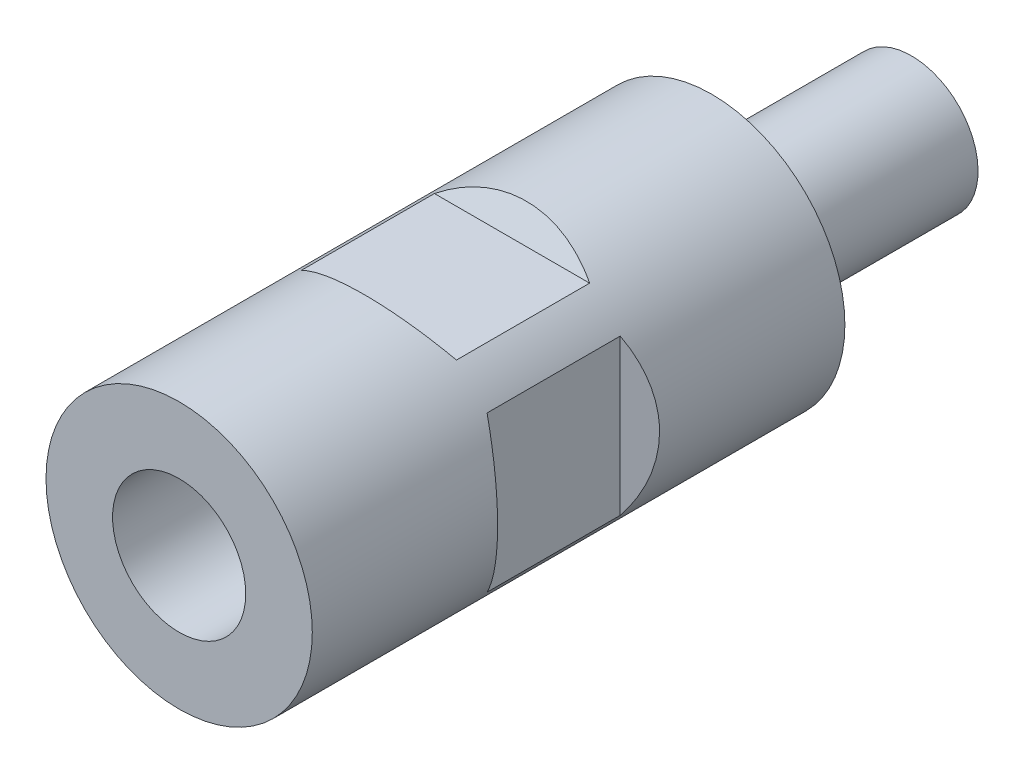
ISO-10303-21;
HEADER;
FILE_DESCRIPTION(('STEP AP214'),'2;1');
FILE_NAME('part.step','',(''),(''),'','','');
FILE_SCHEMA(('AUTOMOTIVE_DESIGN { 1 0 10303 214 1 1 1 1 }'));
ENDSEC;
DATA;
#1=APPLICATION_CONTEXT('core data for automotive mechanical design processes');
#2=APPLICATION_PROTOCOL_DEFINITION('international standard','automotive_design',2000,#1);
#3=PRODUCT_CONTEXT('',#1,'mechanical');
#4=PRODUCT('Part','Part','',(#3));
#5=PRODUCT_RELATED_PRODUCT_CATEGORY('part','',(#4));
#6=PRODUCT_DEFINITION_FORMATION('','',#4);
#7=PRODUCT_DEFINITION_CONTEXT('part definition',#1,'design');
#8=PRODUCT_DEFINITION('design','',#6,#7);
#9=PRODUCT_DEFINITION_SHAPE('','',#8);
#10=(LENGTH_UNIT() NAMED_UNIT(*) SI_UNIT(.MILLI.,.METRE.));
#11=(NAMED_UNIT(*) PLANE_ANGLE_UNIT() SI_UNIT($,.RADIAN.));
#12=(NAMED_UNIT(*) SI_UNIT($,.STERADIAN.) SOLID_ANGLE_UNIT());
#13=UNCERTAINTY_MEASURE_WITH_UNIT(LENGTH_MEASURE(1.E-05),#10,'distance_accuracy_value','');
#14=(GEOMETRIC_REPRESENTATION_CONTEXT(3) GLOBAL_UNCERTAINTY_ASSIGNED_CONTEXT((#13)) GLOBAL_UNIT_ASSIGNED_CONTEXT((#10,
#11,#12)) REPRESENTATION_CONTEXT('',''));
#15=CARTESIAN_POINT('',(0.,0.,0.));
#16=DIRECTION('',(0.,0.,1.));
#17=DIRECTION('',(1.,0.,0.));
#18=AXIS2_PLACEMENT_3D('',#15,#16,#17);
#19=CARTESIAN_POINT('',(0.,0.,-12.));
#20=DIRECTION('',(0.,0.,1.));
#21=DIRECTION('',(0.,-1.,0.));
#22=AXIS2_PLACEMENT_3D('',#19,#20,#21);
#23=PLANE('',#22);
#24=CARTESIAN_POINT('',(0.,0.,-12.));
#25=DIRECTION('',(0.,0.,1.));
#26=DIRECTION('',(0.,-1.,0.));
#27=AXIS2_PLACEMENT_3D('',#24,#25,#26);
#28=CIRCLE('',#27,4.);
#29=CARTESIAN_POINT('',(0.,-4.,-12.));
#30=VERTEX_POINT('',#29);
#31=EDGE_CURVE('E103',#30,#30,#28,.F.);
#32=ORIENTED_EDGE('',*,*,#31,.T.);
#33=EDGE_LOOP('',(#32));
#34=FACE_BOUND('',#33,.T.);
#35=ADVANCED_FACE('F14',(#34),#23,.F.);
#36=CARTESIAN_POINT('',(0.,0.,8.));
#37=DIRECTION('',(0.,0.,1.));
#38=DIRECTION('',(0.,-1.,0.));
#39=AXIS2_PLACEMENT_3D('',#36,#37,#38);
#40=CYLINDRICAL_SURFACE('',#39,4.);
#41=ORIENTED_EDGE('',*,*,#31,.F.);
#42=EDGE_LOOP('',(#41));
#43=FACE_BOUND('',#42,.T.);
#44=CARTESIAN_POINT('',(0.,0.,0.));
#45=DIRECTION('',(0.,0.,1.));
#46=DIRECTION('',(1.,0.,0.));
#47=AXIS2_PLACEMENT_3D('',#44,#45,#46);
#48=CIRCLE('',#47,4.);
#49=CARTESIAN_POINT('',(4.,0.,0.));
#50=VERTEX_POINT('',#49);
#51=EDGE_CURVE('E9',#50,#50,#48,.T.);
#52=ORIENTED_EDGE('',*,*,#51,.F.);
#53=EDGE_LOOP('',(#52));
#54=FACE_BOUND('',#53,.T.);
#55=ADVANCED_FACE('F339',(#43,#54),#40,.T.);
#56=CARTESIAN_POINT('',(0.,-4.,13.));
#57=DIRECTION('',(0.,0.,-1.));
#58=DIRECTION('',(0.,1.,0.));
#59=AXIS2_PLACEMENT_3D('',#56,#57,#58);
#60=PLANE('',#59);
#61=CARTESIAN_POINT('',(0.,0.,13.));
#62=DIRECTION('',(0.,0.,1.));
#63=DIRECTION('',(0.,-1.,0.));
#64=AXIS2_PLACEMENT_3D('',#61,#62,#63);
#65=CIRCLE('',#64,4.);
#66=CARTESIAN_POINT('',(0.,-4.,13.));
#67=VERTEX_POINT('',#66);
#68=EDGE_CURVE('E17',#67,#67,#65,.T.);
#69=ORIENTED_EDGE('',*,*,#68,.T.);
#70=EDGE_LOOP('',(#69));
#71=FACE_BOUND('',#70,.T.);
#72=ADVANCED_FACE('F112',(#71),#60,.F.);
#73=CARTESIAN_POINT('',(6.5,-8.,20.));
#74=DIRECTION('',(-0.5,0.,0.866025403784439));
#75=DIRECTION('',(0.866025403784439,0.,0.5));
#76=AXIS2_PLACEMENT_3D('',#73,#74,#75);
#77=PLANE('',#76);
#78=DIRECTION('',(0.,1.,0.));
#79=VECTOR('',#78,1.);
#80=CARTESIAN_POINT('',(6.5,-8.,20.));
#81=LINE('',#80,#79);
#82=CARTESIAN_POINT('',(6.5,-4.6636895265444,20.));
#83=VERTEX_POINT('',#82);
#84=CARTESIAN_POINT('',(6.5,4.6636895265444,20.));
#85=VERTEX_POINT('',#84);
#86=EDGE_CURVE('E138',#83,#85,#81,.T.);
#87=ORIENTED_EDGE('',*,*,#86,.T.);
#88=CARTESIAN_POINT('',(0.,0.,16.2472232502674));
#89=DIRECTION('',(-0.5,0.,0.866025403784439));
#90=DIRECTION('',(-0.866025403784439,0.,-0.5));
#91=AXIS2_PLACEMENT_3D('',#88,#89,#90);
#92=ELLIPSE('',#91,9.23760430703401,8.);
#93=EDGE_CURVE('E35',#83,#85,#92,.T.);
#94=ORIENTED_EDGE('',*,*,#93,.F.);
#95=EDGE_LOOP('',(#87,#94));
#96=FACE_BOUND('',#95,.T.);
#97=ADVANCED_FACE('F204',(#96),#77,.F.);
#98=CARTESIAN_POINT('',(6.5,-8.,20.));
#99=DIRECTION('',(-1.,0.,0.));
#100=DIRECTION('',(0.,0.,1.));
#101=AXIS2_PLACEMENT_3D('',#98,#99,#100);
#102=PLANE('',#101);
#103=ORIENTED_EDGE('',*,*,#86,.F.);
#104=DIRECTION('',(0.,0.,-1.));
#105=VECTOR('',#104,1.);
#106=CARTESIAN_POINT('',(6.5,-4.6636895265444,32.));
#107=LINE('',#106,#105);
#108=CARTESIAN_POINT('',(6.5,-4.66368952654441,12.));
#109=VERTEX_POINT('',#108);
#110=EDGE_CURVE('E151',#109,#83,#107,.F.);
#111=ORIENTED_EDGE('',*,*,#110,.F.);
#112=DIRECTION('',(0.,1.,0.));
#113=VECTOR('',#112,1.);
#114=CARTESIAN_POINT('',(6.5,-8.,12.));
#115=LINE('',#114,#113);
#116=CARTESIAN_POINT('',(6.5,4.6636895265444,12.));
#117=VERTEX_POINT('',#116);
#118=EDGE_CURVE('E135',#109,#117,#115,.T.);
#119=ORIENTED_EDGE('',*,*,#118,.T.);
#120=DIRECTION('',(0.,0.,-1.));
#121=VECTOR('',#120,1.);
#122=CARTESIAN_POINT('',(6.5,4.6636895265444,32.));
#123=LINE('',#122,#121);
#124=EDGE_CURVE('E29',#85,#117,#123,.T.);
#125=ORIENTED_EDGE('',*,*,#124,.F.);
#126=EDGE_LOOP('',(#103,#111,#119,#125));
#127=FACE_BOUND('',#126,.T.);
#128=ADVANCED_FACE('F214',(#127),#102,.F.);
#129=CARTESIAN_POINT('',(6.5,-8.,12.));
#130=DIRECTION('',(-0.5,0.,-0.866025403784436));
#131=DIRECTION('',(-0.866025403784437,0.,0.5));
#132=AXIS2_PLACEMENT_3D('',#129,#130,#131);
#133=PLANE('',#132);
#134=CARTESIAN_POINT('',(0.,0.,15.7527767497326));
#135=DIRECTION('',(-0.5,0.,-0.866025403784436));
#136=DIRECTION('',(0.866025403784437,0.,-0.5));
#137=AXIS2_PLACEMENT_3D('',#134,#135,#136);
#138=ELLIPSE('',#137,9.23760430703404,8.);
#139=EDGE_CURVE('E147',#117,#109,#138,.T.);
#140=ORIENTED_EDGE('',*,*,#139,.F.);
#141=ORIENTED_EDGE('',*,*,#118,.F.);
#142=EDGE_LOOP('',(#140,#141));
#143=FACE_BOUND('',#142,.T.);
#144=ADVANCED_FACE('F215',(#143),#133,.F.);
#145=CARTESIAN_POINT('',(-6.5,-8.,12.));
#146=DIRECTION('',(0.5,0.,-0.866025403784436));
#147=DIRECTION('',(-0.866025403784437,0.,-0.5));
#148=AXIS2_PLACEMENT_3D('',#145,#146,#147);
#149=PLANE('',#148);
#150=CARTESIAN_POINT('',(0.,0.,15.7527767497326));
#151=DIRECTION('',(0.5,0.,-0.866025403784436));
#152=DIRECTION('',(-0.866025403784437,0.,-0.5));
#153=AXIS2_PLACEMENT_3D('',#150,#151,#152);
#154=ELLIPSE('',#153,9.23760430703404,8.);
#155=CARTESIAN_POINT('',(-6.5,-4.66368952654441,12.));
#156=VERTEX_POINT('',#155);
#157=CARTESIAN_POINT('',(-6.5,4.6636895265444,12.));
#158=VERTEX_POINT('',#157);
#159=EDGE_CURVE('E154',#156,#158,#154,.T.);
#160=ORIENTED_EDGE('',*,*,#159,.F.);
#161=DIRECTION('',(0.,1.,0.));
#162=VECTOR('',#161,1.);
#163=CARTESIAN_POINT('',(-6.5,-8.,12.));
#164=LINE('',#163,#162);
#165=EDGE_CURVE('E129',#156,#158,#164,.T.);
#166=ORIENTED_EDGE('',*,*,#165,.T.);
#167=EDGE_LOOP('',(#160,#166));
#168=FACE_BOUND('',#167,.T.);
#169=ADVANCED_FACE('F218',(#168),#149,.F.);
#170=CARTESIAN_POINT('',(-6.5,-8.,20.));
#171=DIRECTION('',(0.5,0.,0.866025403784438));
#172=DIRECTION('',(0.866025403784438,0.,-0.5));
#173=AXIS2_PLACEMENT_3D('',#170,#171,#172);
#174=PLANE('',#173);
#175=DIRECTION('',(0.,1.,0.));
#176=VECTOR('',#175,1.);
#177=CARTESIAN_POINT('',(-6.5,-8.,20.));
#178=LINE('',#177,#176);
#179=CARTESIAN_POINT('',(-6.5,-4.66368952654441,20.));
#180=VERTEX_POINT('',#179);
#181=CARTESIAN_POINT('',(-6.5,4.66368952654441,20.));
#182=VERTEX_POINT('',#181);
#183=EDGE_CURVE('E132',#180,#182,#178,.T.);
#184=ORIENTED_EDGE('',*,*,#183,.F.);
#185=CARTESIAN_POINT('',(0.,0.,16.2472232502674));
#186=DIRECTION('',(0.5,0.,0.866025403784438));
#187=DIRECTION('',(0.866025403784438,0.,-0.5));
#188=AXIS2_PLACEMENT_3D('',#185,#186,#187);
#189=ELLIPSE('',#188,9.23760430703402,8.);
#190=EDGE_CURVE('E162',#182,#180,#189,.T.);
#191=ORIENTED_EDGE('',*,*,#190,.F.);
#192=EDGE_LOOP('',(#184,#191));
#193=FACE_BOUND('',#192,.T.);
#194=ADVANCED_FACE('F225',(#193),#174,.F.);
#195=CARTESIAN_POINT('',(-6.5,-8.,20.));
#196=DIRECTION('',(1.,0.,0.));
#197=DIRECTION('',(0.,0.,-1.));
#198=AXIS2_PLACEMENT_3D('',#195,#196,#197);
#199=PLANE('',#198);
#200=ORIENTED_EDGE('',*,*,#183,.T.);
#201=DIRECTION('',(0.,0.,-1.));
#202=VECTOR('',#201,1.);
#203=CARTESIAN_POINT('',(-6.5,4.66368952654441,32.));
#204=LINE('',#203,#202);
#205=EDGE_CURVE('E156',#158,#182,#204,.F.);
#206=ORIENTED_EDGE('',*,*,#205,.F.);
#207=ORIENTED_EDGE('',*,*,#165,.F.);
#208=DIRECTION('',(0.,0.,-1.));
#209=VECTOR('',#208,1.);
#210=CARTESIAN_POINT('',(-6.5,-4.66368952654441,32.));
#211=LINE('',#210,#209);
#212=EDGE_CURVE('E159',#180,#156,#211,.T.);
#213=ORIENTED_EDGE('',*,*,#212,.F.);
#214=EDGE_LOOP('',(#200,#206,#207,#213));
#215=FACE_BOUND('',#214,.T.);
#216=ADVANCED_FACE('F220',(#215),#199,.F.);
#217=CARTESIAN_POINT('',(8.,6.5,20.));
#218=DIRECTION('',(0.,-0.5,0.866025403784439));
#219=DIRECTION('',(0.,-0.866025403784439,-0.5));
#220=AXIS2_PLACEMENT_3D('',#217,#218,#219);
#221=PLANE('',#220);
#222=DIRECTION('',(-1.,0.,0.));
#223=VECTOR('',#222,1.);
#224=CARTESIAN_POINT('',(8.,6.5,20.));
#225=LINE('',#224,#223);
#226=CARTESIAN_POINT('',(4.66368952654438,6.5,20.));
#227=VERTEX_POINT('',#226);
#228=CARTESIAN_POINT('',(-4.66368952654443,6.5,20.));
#229=VERTEX_POINT('',#228);
#230=EDGE_CURVE('E126',#227,#229,#225,.T.);
#231=ORIENTED_EDGE('',*,*,#230,.T.);
#232=CARTESIAN_POINT('',(0.,0.,16.2472232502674));
#233=DIRECTION('',(0.,-0.5,0.866025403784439));
#234=DIRECTION('',(0.,-0.866025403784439,-0.5));
#235=AXIS2_PLACEMENT_3D('',#232,#233,#234);
#236=ELLIPSE('',#235,9.23760430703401,8.);
#237=EDGE_CURVE('E170',#227,#229,#236,.T.);
#238=ORIENTED_EDGE('',*,*,#237,.F.);
#239=EDGE_LOOP('',(#231,#238));
#240=FACE_BOUND('',#239,.T.);
#241=ADVANCED_FACE('F191',(#240),#221,.F.);
#242=CARTESIAN_POINT('',(8.,6.5,20.));
#243=DIRECTION('',(0.,-1.,0.));
#244=DIRECTION('',(1.,0.,0.));
#245=AXIS2_PLACEMENT_3D('',#242,#243,#244);
#246=PLANE('',#245);
#247=ORIENTED_EDGE('',*,*,#230,.F.);
#248=DIRECTION('',(0.,0.,-1.));
#249=VECTOR('',#248,1.);
#250=CARTESIAN_POINT('',(4.66368952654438,6.5,32.));
#251=LINE('',#250,#249);
#252=CARTESIAN_POINT('',(4.66368952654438,6.5,12.));
#253=VERTEX_POINT('',#252);
#254=EDGE_CURVE('E88',#253,#227,#251,.F.);
#255=ORIENTED_EDGE('',*,*,#254,.F.);
#256=DIRECTION('',(-1.,0.,0.));
#257=VECTOR('',#256,1.);
#258=CARTESIAN_POINT('',(8.,6.5,12.));
#259=LINE('',#258,#257);
#260=CARTESIAN_POINT('',(-4.66368952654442,6.5,12.));
#261=VERTEX_POINT('',#260);
#262=EDGE_CURVE('E124',#253,#261,#259,.T.);
#263=ORIENTED_EDGE('',*,*,#262,.T.);
#264=DIRECTION('',(0.,0.,-1.));
#265=VECTOR('',#264,1.);
#266=CARTESIAN_POINT('',(-4.66368952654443,6.5,32.));
#267=LINE('',#266,#265);
#268=EDGE_CURVE('E167',#229,#261,#267,.T.);
#269=ORIENTED_EDGE('',*,*,#268,.F.);
#270=EDGE_LOOP('',(#247,#255,#263,#269));
#271=FACE_BOUND('',#270,.T.);
#272=ADVANCED_FACE('F179',(#271),#246,.F.);
#273=CARTESIAN_POINT('',(8.,6.5,12.));
#274=DIRECTION('',(0.,-0.5,-0.866025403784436));
#275=DIRECTION('',(0.,0.866025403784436,-0.5));
#276=AXIS2_PLACEMENT_3D('',#273,#274,#275);
#277=PLANE('',#276);
#278=CARTESIAN_POINT('',(0.,0.,15.7527767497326));
#279=DIRECTION('',(0.,-0.5,-0.866025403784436));
#280=DIRECTION('',(0.,0.866025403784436,-0.5));
#281=AXIS2_PLACEMENT_3D('',#278,#279,#280);
#282=ELLIPSE('',#281,9.23760430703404,8.);
#283=EDGE_CURVE('E165',#261,#253,#282,.T.);
#284=ORIENTED_EDGE('',*,*,#283,.F.);
#285=ORIENTED_EDGE('',*,*,#262,.F.);
#286=EDGE_LOOP('',(#284,#285));
#287=FACE_BOUND('',#286,.T.);
#288=ADVANCED_FACE('F181',(#287),#277,.F.);
#289=CARTESIAN_POINT('',(8.,-6.5,12.));
#290=DIRECTION('',(0.,0.5,-0.866025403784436));
#291=DIRECTION('',(0.,0.866025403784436,0.5));
#292=AXIS2_PLACEMENT_3D('',#289,#290,#291);
#293=PLANE('',#292);
#294=CARTESIAN_POINT('',(0.,0.,15.7527767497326));
#295=DIRECTION('',(0.,0.5,-0.866025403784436));
#296=DIRECTION('',(0.,-0.866025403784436,-0.5));
#297=AXIS2_PLACEMENT_3D('',#294,#295,#296);
#298=ELLIPSE('',#297,9.23760430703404,8.);
#299=CARTESIAN_POINT('',(4.66368952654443,-6.5,12.));
#300=VERTEX_POINT('',#299);
#301=CARTESIAN_POINT('',(-4.66368952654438,-6.5,12.));
#302=VERTEX_POINT('',#301);
#303=EDGE_CURVE('E79',#300,#302,#298,.T.);
#304=ORIENTED_EDGE('',*,*,#303,.F.);
#305=DIRECTION('',(-1.,0.,0.));
#306=VECTOR('',#305,1.);
#307=CARTESIAN_POINT('',(8.,-6.5,12.));
#308=LINE('',#307,#306);
#309=EDGE_CURVE('E82',#300,#302,#308,.T.);
#310=ORIENTED_EDGE('',*,*,#309,.T.);
#311=EDGE_LOOP('',(#304,#310));
#312=FACE_BOUND('',#311,.T.);
#313=ADVANCED_FACE('F81',(#312),#293,.F.);
#314=CARTESIAN_POINT('',(8.,-6.5,20.));
#315=DIRECTION('',(0.,0.5,0.866025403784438));
#316=DIRECTION('',(0.,-0.866025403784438,0.5));
#317=AXIS2_PLACEMENT_3D('',#314,#315,#316);
#318=PLANE('',#317);
#319=DIRECTION('',(-1.,0.,0.));
#320=VECTOR('',#319,1.);
#321=CARTESIAN_POINT('',(8.,-6.5,20.));
#322=LINE('',#321,#320);
#323=CARTESIAN_POINT('',(4.66368952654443,-6.5,20.));
#324=VERTEX_POINT('',#323);
#325=CARTESIAN_POINT('',(-4.66368952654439,-6.5,20.));
#326=VERTEX_POINT('',#325);
#327=EDGE_CURVE('E95',#324,#326,#322,.T.);
#328=ORIENTED_EDGE('',*,*,#327,.F.);
#329=CARTESIAN_POINT('',(0.,0.,16.2472232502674));
#330=DIRECTION('',(0.,0.5,0.866025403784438));
#331=DIRECTION('',(0.,0.866025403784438,-0.5));
#332=AXIS2_PLACEMENT_3D('',#329,#330,#331);
#333=ELLIPSE('',#332,9.23760430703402,8.);
#334=EDGE_CURVE('E101',#326,#324,#333,.T.);
#335=ORIENTED_EDGE('',*,*,#334,.F.);
#336=EDGE_LOOP('',(#328,#335));
#337=FACE_BOUND('',#336,.T.);
#338=ADVANCED_FACE('F189',(#337),#318,.F.);
#339=CARTESIAN_POINT('',(8.,-6.5,20.));
#340=DIRECTION('',(0.,1.,0.));
#341=DIRECTION('',(-1.,0.,0.));
#342=AXIS2_PLACEMENT_3D('',#339,#340,#341);
#343=PLANE('',#342);
#344=ORIENTED_EDGE('',*,*,#327,.T.);
#345=DIRECTION('',(0.,0.,-1.));
#346=VECTOR('',#345,1.);
#347=CARTESIAN_POINT('',(-4.66368952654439,-6.5,32.));
#348=LINE('',#347,#346);
#349=EDGE_CURVE('E87',#302,#326,#348,.F.);
#350=ORIENTED_EDGE('',*,*,#349,.F.);
#351=ORIENTED_EDGE('',*,*,#309,.F.);
#352=DIRECTION('',(0.,0.,-1.));
#353=VECTOR('',#352,1.);
#354=CARTESIAN_POINT('',(4.66368952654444,-6.5,32.));
#355=LINE('',#354,#353);
#356=EDGE_CURVE('E93',#324,#300,#355,.T.);
#357=ORIENTED_EDGE('',*,*,#356,.F.);
#358=EDGE_LOOP('',(#344,#350,#351,#357));
#359=FACE_BOUND('',#358,.T.);
#360=ADVANCED_FACE('F92',(#359),#343,.F.);
#361=CARTESIAN_POINT('',(0.,0.,32.));
#362=DIRECTION('',(0.,0.,-1.));
#363=DIRECTION('',(-1.,0.,0.));
#364=AXIS2_PLACEMENT_3D('',#361,#362,#363);
#365=CYLINDRICAL_SURFACE('',#364,8.);
#366=ORIENTED_EDGE('',*,*,#349,.T.);
#367=ORIENTED_EDGE('',*,*,#334,.T.);
#368=ORIENTED_EDGE('',*,*,#356,.T.);
#369=ORIENTED_EDGE('',*,*,#303,.T.);
#370=EDGE_LOOP('',(#366,#367,#368,#369));
#371=FACE_BOUND('',#370,.T.);
#372=ORIENTED_EDGE('',*,*,#283,.T.);
#373=ORIENTED_EDGE('',*,*,#254,.T.);
#374=ORIENTED_EDGE('',*,*,#237,.T.);
#375=ORIENTED_EDGE('',*,*,#268,.T.);
#376=EDGE_LOOP('',(#372,#373,#374,#375));
#377=FACE_BOUND('',#376,.T.);
#378=ORIENTED_EDGE('',*,*,#205,.T.);
#379=ORIENTED_EDGE('',*,*,#190,.T.);
#380=ORIENTED_EDGE('',*,*,#212,.T.);
#381=ORIENTED_EDGE('',*,*,#159,.T.);
#382=EDGE_LOOP('',(#378,#379,#380,#381));
#383=FACE_BOUND('',#382,.T.);
#384=ORIENTED_EDGE('',*,*,#139,.T.);
#385=ORIENTED_EDGE('',*,*,#110,.T.);
#386=ORIENTED_EDGE('',*,*,#93,.T.);
#387=ORIENTED_EDGE('',*,*,#124,.T.);
#388=EDGE_LOOP('',(#384,#385,#386,#387));
#389=FACE_BOUND('',#388,.T.);
#390=CARTESIAN_POINT('',(0.,0.,32.));
#391=DIRECTION('',(0.,0.,1.));
#392=DIRECTION('',(1.,0.,0.));
#393=AXIS2_PLACEMENT_3D('',#390,#391,#392);
#394=CIRCLE('',#393,8.);
#395=CARTESIAN_POINT('',(8.,0.,32.));
#396=VERTEX_POINT('',#395);
#397=EDGE_CURVE('E144',#396,#396,#394,.T.);
#398=ORIENTED_EDGE('',*,*,#397,.F.);
#399=EDGE_LOOP('',(#398));
#400=FACE_BOUND('',#399,.T.);
#401=CARTESIAN_POINT('',(0.,0.,0.));
#402=DIRECTION('',(0.,0.,1.));
#403=DIRECTION('',(1.,0.,0.));
#404=AXIS2_PLACEMENT_3D('',#401,#402,#403);
#405=CIRCLE('',#404,8.);
#406=CARTESIAN_POINT('',(8.,0.,0.));
#407=VERTEX_POINT('',#406);
#408=EDGE_CURVE('E140',#407,#407,#405,.T.);
#409=ORIENTED_EDGE('',*,*,#408,.T.);
#410=EDGE_LOOP('',(#409));
#411=FACE_BOUND('',#410,.T.);
#412=ADVANCED_FACE('F99',(#371,#377,#383,#389,#400,#411),#365,.T.);
#413=CARTESIAN_POINT('',(0.,0.,0.));
#414=DIRECTION('',(0.,0.,1.));
#415=DIRECTION('',(1.,0.,0.));
#416=AXIS2_PLACEMENT_3D('',#413,#414,#415);
#417=PLANE('',#416);
#418=ORIENTED_EDGE('',*,*,#51,.T.);
#419=EDGE_LOOP('',(#418));
#420=FACE_BOUND('',#419,.T.);
#421=ORIENTED_EDGE('',*,*,#408,.F.);
#422=EDGE_LOOP('',(#421));
#423=FACE_BOUND('',#422,.T.);
#424=ADVANCED_FACE('F197',(#420,#423),#417,.F.);
#425=CARTESIAN_POINT('',(0.,0.,32.));
#426=DIRECTION('',(0.,0.,1.));
#427=DIRECTION('',(1.,0.,0.));
#428=AXIS2_PLACEMENT_3D('',#425,#426,#427);
#429=PLANE('',#428);
#430=CARTESIAN_POINT('',(0.,0.,32.));
#431=DIRECTION('',(0.,0.,1.));
#432=DIRECTION('',(1.,0.,0.));
#433=AXIS2_PLACEMENT_3D('',#430,#431,#432);
#434=CIRCLE('',#433,4.);
#435=CARTESIAN_POINT('',(4.,0.,32.));
#436=VERTEX_POINT('',#435);
#437=EDGE_CURVE('E96',#436,#436,#434,.T.);
#438=ORIENTED_EDGE('',*,*,#437,.F.);
#439=EDGE_LOOP('',(#438));
#440=FACE_BOUND('',#439,.T.);
#441=ORIENTED_EDGE('',*,*,#397,.T.);
#442=EDGE_LOOP('',(#441));
#443=FACE_BOUND('',#442,.T.);
#444=ADVANCED_FACE('F117',(#440,#443),#429,.T.);
#445=CARTESIAN_POINT('',(0.,0.,32.));
#446=DIRECTION('',(0.,0.,1.));
#447=DIRECTION('',(1.,0.,0.));
#448=AXIS2_PLACEMENT_3D('',#445,#446,#447);
#449=CYLINDRICAL_SURFACE('',#448,4.);
#450=ORIENTED_EDGE('',*,*,#68,.F.);
#451=EDGE_LOOP('',(#450));
#452=FACE_BOUND('',#451,.T.);
#453=ORIENTED_EDGE('',*,*,#437,.T.);
#454=EDGE_LOOP('',(#453));
#455=FACE_BOUND('',#454,.T.);
#456=ADVANCED_FACE('F114',(#452,#455),#449,.F.);
#457=CLOSED_SHELL('',(#35,#55,#72,#97,#128,#144,#169,#194,#216,#241,#272,#288,#313,#338,#360,
#412,#424,#444,#456));
#458=MANIFOLD_SOLID_BREP('B1',#457);
#459=ADVANCED_BREP_SHAPE_REPRESENTATION('',(#18,#458),#14);
#460=SHAPE_DEFINITION_REPRESENTATION(#9,#459);
ENDSEC;
END-ISO-10303-21;
